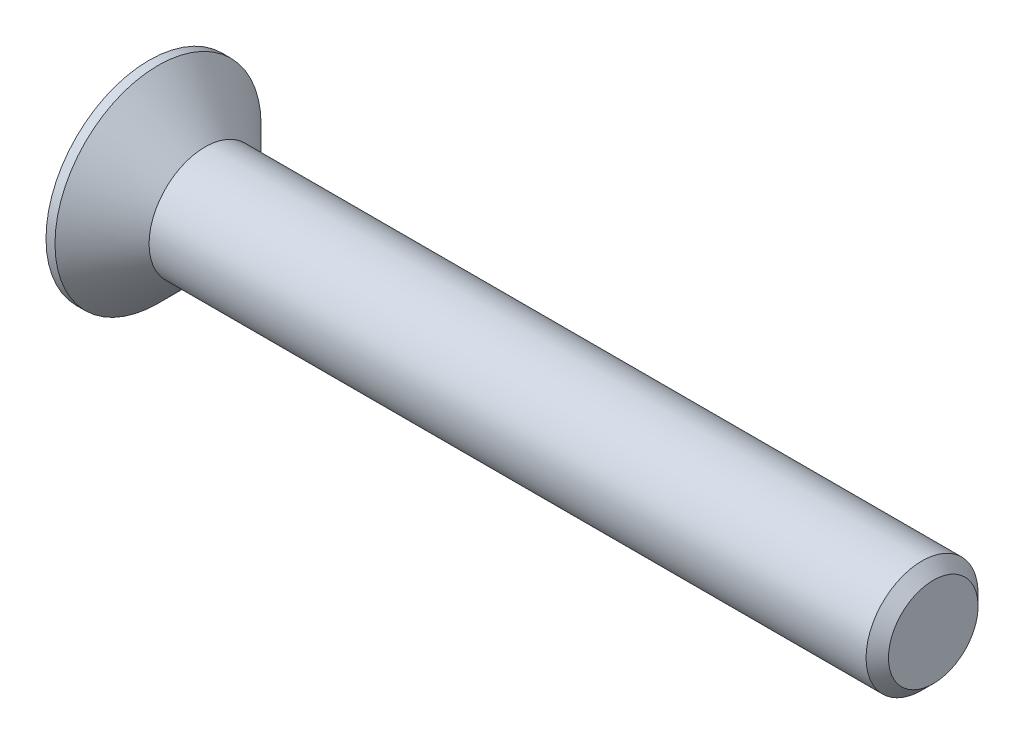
from build123d import *

# Parameters (mm, degrees)
CHAMFER1_SIZE      = 0.5
CUT_EXTRUDE1_DEPTH = 2.1


with BuildPart() as part:
    # Sketch1 → Revolve1 (revolve)
    with BuildSketch(Plane.XY, mode=Mode.PRIVATE) as revolve1_sk:
        Polygon((-2.5, 4.6), (-2.5, 0), (32.5, 0), (32.5, 2.5), (0, 2.5), (-2.1, 4.6), align=None)
    revolve(revolve1_sk.sketch.rotate(Axis((-2.5, 0, 0), (1, 0, 0)), 90), axis=Axis((-2.5, 0, 0), (1, 0, 0)))

    # Chamfer1
    chamfer1_edges = [part.edges().sort_by_distance(p)[0] for p in [
        (32.5, 0, -2.5),
    ]]
    chamfer(chamfer1_edges, length=CHAMFER1_SIZE)

    # Sketch2 → Cut-Extrude1 (cut)
    with BuildSketch(Plane.ZY.offset(2.5)):
        Polygon((-0.575, 2.3), (0.575, 2.3), (0.575, 0.575), (2.3, 0.575), (2.3, -0.575), (0.575, -0.575), (0.575, -2.3), (-0.575, -2.3), (-0.575, -0.575), (-2.3, -0.575), (-2.3, 0.575), (-0.575, 0.575), align=None)
    extrude(amount=-CUT_EXTRUDE1_DEPTH, mode=Mode.SUBTRACT)


solid = part.part
